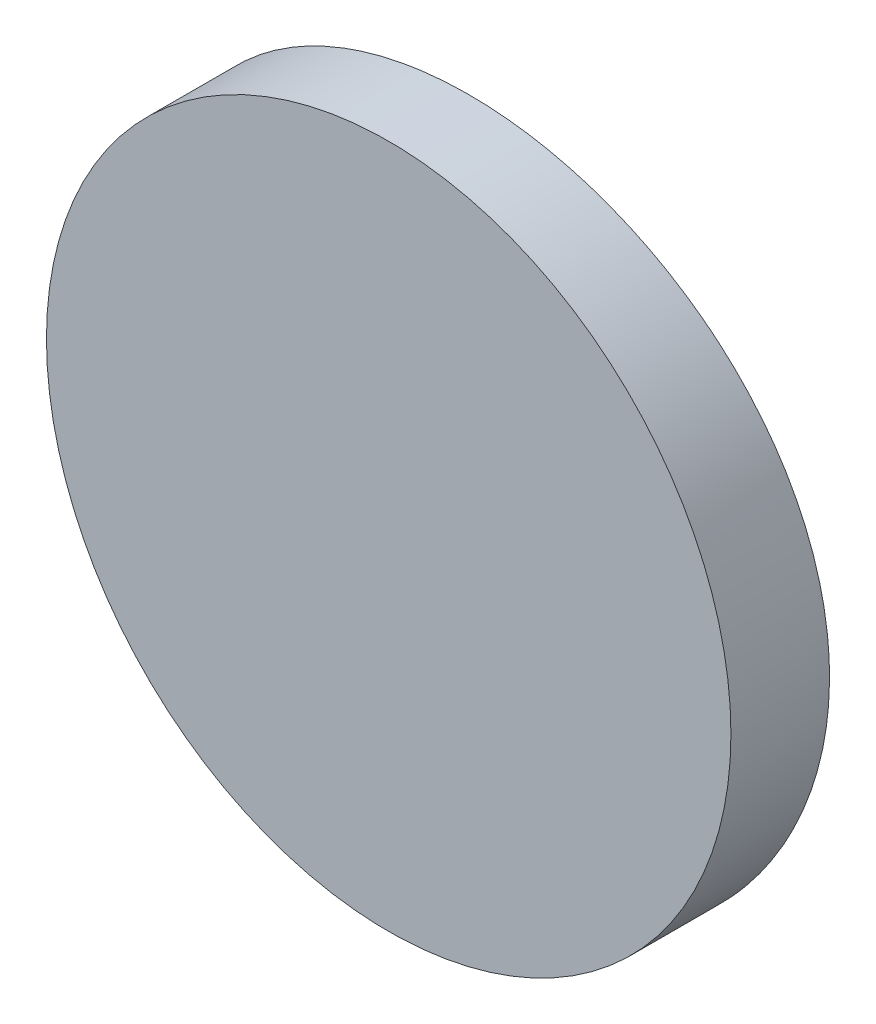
from build123d import *

# Parameters (mm, degrees)
SKETCH2_R           = 4
BOSS_EXTRUDE1_DEPTH = 2
SKETCH4_W           = 37.72
SKETCH4_H           = 8.390922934
SKETCH5_R           = 4
BOSS_EXTRUDE2_DEPTH = 0.11


with BuildPart() as part:
    # Sketch2 → Boss-Extrude1 (new body)
    with BuildSketch(Plane.XY):
        Circle(SKETCH2_R)
    extrude(amount=BOSS_EXTRUDE1_DEPTH)

    # Sketch4 → Cut-Revolve1 (revolve, cut)
    with BuildSketch(Plane(origin=(0, 0, 0), x_dir=(0, 0, -1), z_dir=(1, 0, 0))):
        with Locations((17.69, 0.094879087)):
            Rectangle(SKETCH4_W, SKETCH4_H)
    revolve(axis=Axis((0, 4.290340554, -36.55), (0, -1, 0)), mode=Mode.SUBTRACT)

    # Sketch5 → Boss-Extrude2 (add)
    with BuildSketch(Plane.XY.offset(2)):
        with Locations(Location((0, 0, 0), (0, 0, 180))):
            Circle(SKETCH5_R)
    extrude(amount=BOSS_EXTRUDE2_DEPTH)


solid = part.part
